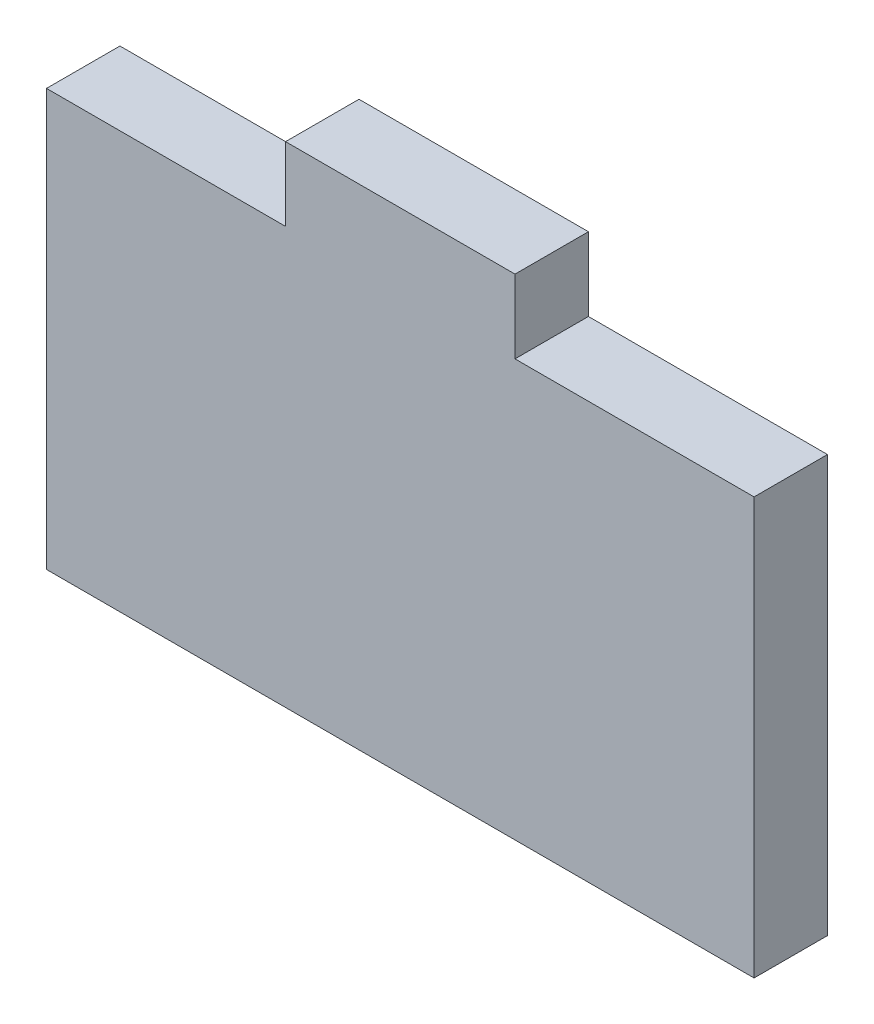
ISO-10303-21;
HEADER;
FILE_DESCRIPTION(('STEP AP214'),'2;1');
FILE_NAME('part.step','',(''),(''),'','','');
FILE_SCHEMA(('AUTOMOTIVE_DESIGN { 1 0 10303 214 1 1 1 1 }'));
ENDSEC;
DATA;
#1=APPLICATION_CONTEXT('core data for automotive mechanical design processes');
#2=APPLICATION_PROTOCOL_DEFINITION('international standard','automotive_design',2000,#1);
#3=PRODUCT_CONTEXT('',#1,'mechanical');
#4=PRODUCT('Part','Part','',(#3));
#5=PRODUCT_RELATED_PRODUCT_CATEGORY('part','',(#4));
#6=PRODUCT_DEFINITION_FORMATION('','',#4);
#7=PRODUCT_DEFINITION_CONTEXT('part definition',#1,'design');
#8=PRODUCT_DEFINITION('design','',#6,#7);
#9=PRODUCT_DEFINITION_SHAPE('','',#8);
#10=(LENGTH_UNIT() NAMED_UNIT(*) SI_UNIT(.MILLI.,.METRE.));
#11=(NAMED_UNIT(*) PLANE_ANGLE_UNIT() SI_UNIT($,.RADIAN.));
#12=(NAMED_UNIT(*) SI_UNIT($,.STERADIAN.) SOLID_ANGLE_UNIT());
#13=UNCERTAINTY_MEASURE_WITH_UNIT(LENGTH_MEASURE(1.E-05),#10,'distance_accuracy_value','');
#14=(GEOMETRIC_REPRESENTATION_CONTEXT(3) GLOBAL_UNCERTAINTY_ASSIGNED_CONTEXT((#13)) GLOBAL_UNIT_ASSIGNED_CONTEXT((#10,
#11,#12)) REPRESENTATION_CONTEXT('',''));
#15=CARTESIAN_POINT('',(0.,0.,0.));
#16=DIRECTION('',(0.,0.,1.));
#17=DIRECTION('',(1.,0.,0.));
#18=AXIS2_PLACEMENT_3D('',#15,#16,#17);
#19=CARTESIAN_POINT('',(0.,0.,16.));
#20=DIRECTION('',(0.,1.,0.));
#21=DIRECTION('',(0.,0.,1.));
#22=AXIS2_PLACEMENT_3D('',#19,#20,#21);
#23=PLANE('',#22);
#24=DIRECTION('',(1.,0.,0.));
#25=VECTOR('',#24,1.);
#26=CARTESIAN_POINT('',(0.,0.,0.));
#27=LINE('',#26,#25);
#28=CARTESIAN_POINT('',(0.,0.,0.));
#29=VERTEX_POINT('',#28);
#30=CARTESIAN_POINT('',(154.2,0.,0.));
#31=VERTEX_POINT('',#30);
#32=EDGE_CURVE('E82',#29,#31,#27,.T.);
#33=ORIENTED_EDGE('',*,*,#32,.T.);
#34=DIRECTION('',(0.,0.,-1.));
#35=VECTOR('',#34,1.);
#36=CARTESIAN_POINT('',(154.2,0.,16.));
#37=LINE('',#36,#35);
#38=CARTESIAN_POINT('',(154.2,0.,16.));
#39=VERTEX_POINT('',#38);
#40=EDGE_CURVE('E99',#39,#31,#37,.T.);
#41=ORIENTED_EDGE('',*,*,#40,.F.);
#42=DIRECTION('',(1.,0.,0.));
#43=VECTOR('',#42,1.);
#44=CARTESIAN_POINT('',(0.,0.,16.));
#45=LINE('',#44,#43);
#46=CARTESIAN_POINT('',(0.,0.,16.));
#47=VERTEX_POINT('',#46);
#48=EDGE_CURVE('E132',#47,#39,#45,.T.);
#49=ORIENTED_EDGE('',*,*,#48,.F.);
#50=DIRECTION('',(0.,0.,-1.));
#51=VECTOR('',#50,1.);
#52=CARTESIAN_POINT('',(0.,0.,16.));
#53=LINE('',#52,#51);
#54=EDGE_CURVE('E138',#47,#29,#53,.T.);
#55=ORIENTED_EDGE('',*,*,#54,.T.);
#56=EDGE_LOOP('',(#33,#41,#49,#55));
#57=FACE_BOUND('',#56,.T.);
#58=ADVANCED_FACE('F33',(#57),#23,.F.);
#59=CARTESIAN_POINT('',(154.2,0.,16.));
#60=DIRECTION('',(-1.,0.,0.));
#61=DIRECTION('',(0.,0.,1.));
#62=AXIS2_PLACEMENT_3D('',#59,#60,#61);
#63=PLANE('',#62);
#64=DIRECTION('',(0.,1.,0.));
#65=VECTOR('',#64,1.);
#66=CARTESIAN_POINT('',(154.2,0.,0.));
#67=LINE('',#66,#65);
#68=CARTESIAN_POINT('',(154.2,90.8,0.));
#69=VERTEX_POINT('',#68);
#70=EDGE_CURVE('E140',#31,#69,#67,.T.);
#71=ORIENTED_EDGE('',*,*,#70,.T.);
#72=DIRECTION('',(0.,0.,-1.));
#73=VECTOR('',#72,1.);
#74=CARTESIAN_POINT('',(154.2,90.8,16.));
#75=LINE('',#74,#73);
#76=CARTESIAN_POINT('',(154.2,90.8,16.));
#77=VERTEX_POINT('',#76);
#78=EDGE_CURVE('E105',#77,#69,#75,.T.);
#79=ORIENTED_EDGE('',*,*,#78,.F.);
#80=DIRECTION('',(0.,1.,0.));
#81=VECTOR('',#80,1.);
#82=CARTESIAN_POINT('',(154.2,0.,16.));
#83=LINE('',#82,#81);
#84=EDGE_CURVE('E127',#39,#77,#83,.T.);
#85=ORIENTED_EDGE('',*,*,#84,.F.);
#86=ORIENTED_EDGE('',*,*,#40,.T.);
#87=EDGE_LOOP('',(#71,#79,#85,#86));
#88=FACE_BOUND('',#87,.T.);
#89=ADVANCED_FACE('F176',(#88),#63,.F.);
#90=CARTESIAN_POINT('',(0.,0.,16.));
#91=DIRECTION('',(-1.,0.,0.));
#92=DIRECTION('',(0.,0.,1.));
#93=AXIS2_PLACEMENT_3D('',#90,#91,#92);
#94=PLANE('',#93);
#95=DIRECTION('',(0.,1.,0.));
#96=VECTOR('',#95,1.);
#97=CARTESIAN_POINT('',(0.,0.,0.));
#98=LINE('',#97,#96);
#99=CARTESIAN_POINT('',(0.,90.8,0.));
#100=VERTEX_POINT('',#99);
#101=EDGE_CURVE('E145',#29,#100,#98,.T.);
#102=ORIENTED_EDGE('',*,*,#101,.F.);
#103=ORIENTED_EDGE('',*,*,#54,.F.);
#104=DIRECTION('',(0.,1.,0.));
#105=VECTOR('',#104,1.);
#106=CARTESIAN_POINT('',(0.,0.,16.));
#107=LINE('',#106,#105);
#108=CARTESIAN_POINT('',(0.,90.8,16.));
#109=VERTEX_POINT('',#108);
#110=EDGE_CURVE('E131',#47,#109,#107,.T.);
#111=ORIENTED_EDGE('',*,*,#110,.T.);
#112=DIRECTION('',(0.,0.,-1.));
#113=VECTOR('',#112,1.);
#114=CARTESIAN_POINT('',(0.,90.8,16.));
#115=LINE('',#114,#113);
#116=EDGE_CURVE('E113',#109,#100,#115,.T.);
#117=ORIENTED_EDGE('',*,*,#116,.T.);
#118=EDGE_LOOP('',(#102,#103,#111,#117));
#119=FACE_BOUND('',#118,.T.);
#120=ADVANCED_FACE('F154',(#119),#94,.T.);
#121=CARTESIAN_POINT('',(0.,0.,0.));
#122=DIRECTION('',(0.,0.,1.));
#123=DIRECTION('',(1.,0.,0.));
#124=AXIS2_PLACEMENT_3D('',#121,#122,#123);
#125=PLANE('',#124);
#126=ORIENTED_EDGE('',*,*,#32,.F.);
#127=ORIENTED_EDGE('',*,*,#101,.T.);
#128=DIRECTION('',(1.,0.,0.));
#129=VECTOR('',#128,1.);
#130=CARTESIAN_POINT('',(0.,90.8,0.));
#131=LINE('',#130,#129);
#132=CARTESIAN_POINT('',(52.0999999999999,90.8,0.));
#133=VERTEX_POINT('',#132);
#134=EDGE_CURVE('E143',#100,#133,#131,.T.);
#135=ORIENTED_EDGE('',*,*,#134,.T.);
#136=DIRECTION('',(0.,1.,0.));
#137=VECTOR('',#136,1.);
#138=CARTESIAN_POINT('',(52.0999999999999,90.8,0.));
#139=LINE('',#138,#137);
#140=CARTESIAN_POINT('',(52.0999999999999,106.8,0.));
#141=VERTEX_POINT('',#140);
#142=EDGE_CURVE('E93',#133,#141,#139,.T.);
#143=ORIENTED_EDGE('',*,*,#142,.T.);
#144=DIRECTION('',(1.,0.,0.));
#145=VECTOR('',#144,1.);
#146=CARTESIAN_POINT('',(52.0999999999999,106.8,0.));
#147=LINE('',#146,#145);
#148=CARTESIAN_POINT('',(102.1,106.8,0.));
#149=VERTEX_POINT('',#148);
#150=EDGE_CURVE('E77',#141,#149,#147,.T.);
#151=ORIENTED_EDGE('',*,*,#150,.T.);
#152=DIRECTION('',(0.,1.,0.));
#153=VECTOR('',#152,1.);
#154=CARTESIAN_POINT('',(102.1,90.8,0.));
#155=LINE('',#154,#153);
#156=CARTESIAN_POINT('',(102.1,90.8,0.));
#157=VERTEX_POINT('',#156);
#158=EDGE_CURVE('E84',#157,#149,#155,.T.);
#159=ORIENTED_EDGE('',*,*,#158,.F.);
#160=EDGE_CURVE('E142',#157,#69,#131,.T.);
#161=ORIENTED_EDGE('',*,*,#160,.T.);
#162=ORIENTED_EDGE('',*,*,#70,.F.);
#163=EDGE_LOOP('',(#126,#127,#135,#143,#151,#159,#161,#162));
#164=FACE_BOUND('',#163,.T.);
#165=ADVANCED_FACE('F91',(#164),#125,.F.);
#166=CARTESIAN_POINT('',(0.,0.,16.));
#167=DIRECTION('',(0.,0.,1.));
#168=DIRECTION('',(1.,0.,0.));
#169=AXIS2_PLACEMENT_3D('',#166,#167,#168);
#170=PLANE('',#169);
#171=ORIENTED_EDGE('',*,*,#48,.T.);
#172=ORIENTED_EDGE('',*,*,#84,.T.);
#173=DIRECTION('',(1.,0.,0.));
#174=VECTOR('',#173,1.);
#175=CARTESIAN_POINT('',(0.,90.8,16.));
#176=LINE('',#175,#174);
#177=CARTESIAN_POINT('',(102.1,90.8,16.));
#178=VERTEX_POINT('',#177);
#179=EDGE_CURVE('E125',#178,#77,#176,.T.);
#180=ORIENTED_EDGE('',*,*,#179,.F.);
#181=DIRECTION('',(0.,1.,0.));
#182=VECTOR('',#181,1.);
#183=CARTESIAN_POINT('',(102.1,90.8,16.));
#184=LINE('',#183,#182);
#185=CARTESIAN_POINT('',(102.1,106.8,16.));
#186=VERTEX_POINT('',#185);
#187=EDGE_CURVE('E118',#178,#186,#184,.T.);
#188=ORIENTED_EDGE('',*,*,#187,.T.);
#189=DIRECTION('',(1.,0.,0.));
#190=VECTOR('',#189,1.);
#191=CARTESIAN_POINT('',(52.0999999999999,106.8,16.));
#192=LINE('',#191,#190);
#193=CARTESIAN_POINT('',(52.0999999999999,106.8,16.));
#194=VERTEX_POINT('',#193);
#195=EDGE_CURVE('E80',#194,#186,#192,.T.);
#196=ORIENTED_EDGE('',*,*,#195,.F.);
#197=DIRECTION('',(0.,1.,0.));
#198=VECTOR('',#197,1.);
#199=CARTESIAN_POINT('',(52.0999999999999,90.8,16.));
#200=LINE('',#199,#198);
#201=CARTESIAN_POINT('',(52.0999999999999,90.8,16.));
#202=VERTEX_POINT('',#201);
#203=EDGE_CURVE('E88',#202,#194,#200,.T.);
#204=ORIENTED_EDGE('',*,*,#203,.F.);
#205=EDGE_CURVE('E129',#109,#202,#176,.T.);
#206=ORIENTED_EDGE('',*,*,#205,.F.);
#207=ORIENTED_EDGE('',*,*,#110,.F.);
#208=EDGE_LOOP('',(#171,#172,#180,#188,#196,#204,#206,#207));
#209=FACE_BOUND('',#208,.T.);
#210=ADVANCED_FACE('F122',(#209),#170,.T.);
#211=CARTESIAN_POINT('',(0.,90.8,16.));
#212=DIRECTION('',(0.,1.,0.));
#213=DIRECTION('',(0.,0.,1.));
#214=AXIS2_PLACEMENT_3D('',#211,#212,#213);
#215=PLANE('',#214);
#216=ORIENTED_EDGE('',*,*,#205,.T.);
#217=DIRECTION('',(0.,0.,-1.));
#218=VECTOR('',#217,1.);
#219=CARTESIAN_POINT('',(52.0999999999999,90.8,16.));
#220=LINE('',#219,#218);
#221=EDGE_CURVE('E43',#202,#133,#220,.T.);
#222=ORIENTED_EDGE('',*,*,#221,.T.);
#223=ORIENTED_EDGE('',*,*,#134,.F.);
#224=ORIENTED_EDGE('',*,*,#116,.F.);
#225=EDGE_LOOP('',(#216,#222,#223,#224));
#226=FACE_BOUND('',#225,.T.);
#227=ADVANCED_FACE('F162',(#226),#215,.T.);
#228=DIRECTION('',(0.,0.,-1.));
#229=VECTOR('',#228,1.);
#230=CARTESIAN_POINT('',(102.1,90.8,16.));
#231=LINE('',#230,#229);
#232=EDGE_CURVE('E11',#178,#157,#231,.T.);
#233=ORIENTED_EDGE('',*,*,#232,.F.);
#234=ORIENTED_EDGE('',*,*,#179,.T.);
#235=ORIENTED_EDGE('',*,*,#78,.T.);
#236=ORIENTED_EDGE('',*,*,#160,.F.);
#237=EDGE_LOOP('',(#233,#234,#235,#236));
#238=FACE_BOUND('',#237,.T.);
#239=ADVANCED_FACE('F178',(#238),#215,.T.);
#240=CARTESIAN_POINT('',(52.0999999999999,106.8,16.));
#241=DIRECTION('',(0.,1.,0.));
#242=DIRECTION('',(0.,0.,1.));
#243=AXIS2_PLACEMENT_3D('',#240,#241,#242);
#244=PLANE('',#243);
#245=ORIENTED_EDGE('',*,*,#150,.F.);
#246=DIRECTION('',(0.,0.,-1.));
#247=VECTOR('',#246,1.);
#248=CARTESIAN_POINT('',(52.0999999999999,106.8,16.));
#249=LINE('',#248,#247);
#250=EDGE_CURVE('E37',#194,#141,#249,.T.);
#251=ORIENTED_EDGE('',*,*,#250,.F.);
#252=ORIENTED_EDGE('',*,*,#195,.T.);
#253=DIRECTION('',(0.,0.,-1.));
#254=VECTOR('',#253,1.);
#255=CARTESIAN_POINT('',(102.1,106.8,16.));
#256=LINE('',#255,#254);
#257=EDGE_CURVE('E73',#186,#149,#256,.T.);
#258=ORIENTED_EDGE('',*,*,#257,.T.);
#259=EDGE_LOOP('',(#245,#251,#252,#258));
#260=FACE_BOUND('',#259,.T.);
#261=ADVANCED_FACE('F75',(#260),#244,.T.);
#262=CARTESIAN_POINT('',(52.0999999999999,90.8,16.));
#263=DIRECTION('',(-1.,0.,0.));
#264=DIRECTION('',(0.,0.,1.));
#265=AXIS2_PLACEMENT_3D('',#262,#263,#264);
#266=PLANE('',#265);
#267=ORIENTED_EDGE('',*,*,#142,.F.);
#268=ORIENTED_EDGE('',*,*,#221,.F.);
#269=ORIENTED_EDGE('',*,*,#203,.T.);
#270=ORIENTED_EDGE('',*,*,#250,.T.);
#271=EDGE_LOOP('',(#267,#268,#269,#270));
#272=FACE_BOUND('',#271,.T.);
#273=ADVANCED_FACE('F35',(#272),#266,.T.);
#274=CARTESIAN_POINT('',(102.1,90.8,16.));
#275=DIRECTION('',(-1.,0.,0.));
#276=DIRECTION('',(0.,0.,1.));
#277=AXIS2_PLACEMENT_3D('',#274,#275,#276);
#278=PLANE('',#277);
#279=ORIENTED_EDGE('',*,*,#158,.T.);
#280=ORIENTED_EDGE('',*,*,#257,.F.);
#281=ORIENTED_EDGE('',*,*,#187,.F.);
#282=ORIENTED_EDGE('',*,*,#232,.T.);
#283=EDGE_LOOP('',(#279,#280,#281,#282));
#284=FACE_BOUND('',#283,.T.);
#285=ADVANCED_FACE('F85',(#284),#278,.F.);
#286=CLOSED_SHELL('',(#58,#89,#120,#165,#210,#227,#239,#261,#273,#285));
#287=MANIFOLD_SOLID_BREP('B2',#286);
#288=ADVANCED_BREP_SHAPE_REPRESENTATION('',(#18,#287),#14);
#289=SHAPE_DEFINITION_REPRESENTATION(#9,#288);
ENDSEC;
END-ISO-10303-21;
